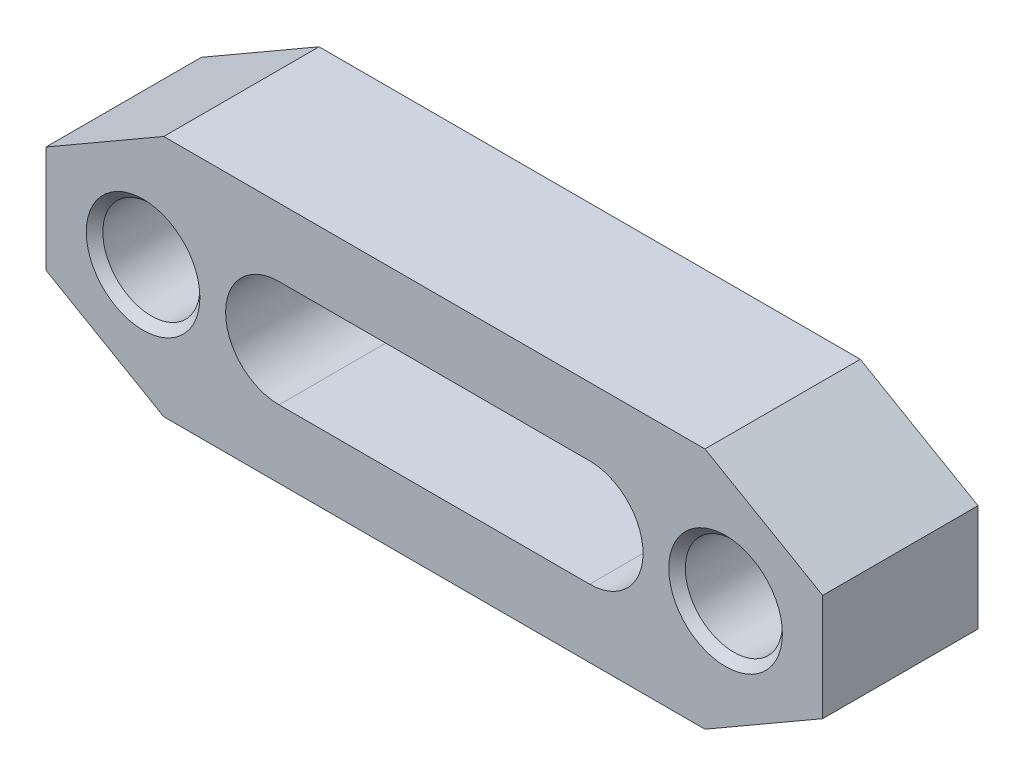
ISO-10303-21;
HEADER;
FILE_DESCRIPTION(('STEP AP214'),'2;1');
FILE_NAME('part.step','',(''),(''),'','','');
FILE_SCHEMA(('AUTOMOTIVE_DESIGN { 1 0 10303 214 1 1 1 1 }'));
ENDSEC;
DATA;
#1=APPLICATION_CONTEXT('core data for automotive mechanical design processes');
#2=APPLICATION_PROTOCOL_DEFINITION('international standard','automotive_design',2000,#1);
#3=PRODUCT_CONTEXT('',#1,'mechanical');
#4=PRODUCT('Part','Part','',(#3));
#5=PRODUCT_RELATED_PRODUCT_CATEGORY('part','',(#4));
#6=PRODUCT_DEFINITION_FORMATION('','',#4);
#7=PRODUCT_DEFINITION_CONTEXT('part definition',#1,'design');
#8=PRODUCT_DEFINITION('design','',#6,#7);
#9=PRODUCT_DEFINITION_SHAPE('','',#8);
#10=(LENGTH_UNIT() NAMED_UNIT(*) SI_UNIT(.MILLI.,.METRE.));
#11=(NAMED_UNIT(*) PLANE_ANGLE_UNIT() SI_UNIT($,.RADIAN.));
#12=(NAMED_UNIT(*) SI_UNIT($,.STERADIAN.) SOLID_ANGLE_UNIT());
#13=UNCERTAINTY_MEASURE_WITH_UNIT(LENGTH_MEASURE(1.E-05),#10,'distance_accuracy_value','');
#14=(GEOMETRIC_REPRESENTATION_CONTEXT(3) GLOBAL_UNCERTAINTY_ASSIGNED_CONTEXT((#13)) GLOBAL_UNIT_ASSIGNED_CONTEXT((#10,
#11,#12)) REPRESENTATION_CONTEXT('',''));
#15=CARTESIAN_POINT('',(0.,0.,0.));
#16=DIRECTION('',(0.,0.,1.));
#17=DIRECTION('',(1.,0.,0.));
#18=AXIS2_PLACEMENT_3D('',#15,#16,#17);
#19=CARTESIAN_POINT('',(40.,-12.5,16.));
#20=DIRECTION('',(0.,0.,1.));
#21=DIRECTION('',(1.,0.,0.));
#22=AXIS2_PLACEMENT_3D('',#19,#20,#21);
#23=PLANE('',#22);
#24=CARTESIAN_POINT('',(30.,0.,16.));
#25=DIRECTION('',(0.,0.,-1.));
#26=DIRECTION('',(-1.,0.,0.));
#27=AXIS2_PLACEMENT_3D('',#24,#25,#26);
#28=CIRCLE('',#27,5.85);
#29=CARTESIAN_POINT('',(24.15,0.,16.));
#30=VERTEX_POINT('',#29);
#31=EDGE_CURVE('E212',#30,#30,#28,.T.);
#32=ORIENTED_EDGE('',*,*,#31,.T.);
#33=EDGE_LOOP('',(#32));
#34=FACE_BOUND('',#33,.T.);
#35=CARTESIAN_POINT('',(-30.,0.,16.));
#36=DIRECTION('',(0.,0.,-1.));
#37=DIRECTION('',(-1.,0.,0.));
#38=AXIS2_PLACEMENT_3D('',#35,#36,#37);
#39=CIRCLE('',#38,5.85);
#40=CARTESIAN_POINT('',(-35.85,0.,16.));
#41=VERTEX_POINT('',#40);
#42=EDGE_CURVE('E133',#41,#41,#39,.T.);
#43=ORIENTED_EDGE('',*,*,#42,.T.);
#44=EDGE_LOOP('',(#43));
#45=FACE_BOUND('',#44,.T.);
#46=DIRECTION('',(1.,0.,0.));
#47=VECTOR('',#46,1.);
#48=CARTESIAN_POINT('',(-27.8756443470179,-12.5,16.));
#49=LINE('',#48,#47);
#50=CARTESIAN_POINT('',(-27.8756443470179,-12.5,16.));
#51=VERTEX_POINT('',#50);
#52=CARTESIAN_POINT('',(27.8756443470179,-12.5,16.));
#53=VERTEX_POINT('',#52);
#54=EDGE_CURVE('E143',#51,#53,#49,.T.);
#55=ORIENTED_EDGE('',*,*,#54,.T.);
#56=DIRECTION('',(0.866025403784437,0.5,0.));
#57=VECTOR('',#56,1.);
#58=CARTESIAN_POINT('',(27.8756443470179,-12.5,16.));
#59=LINE('',#58,#57);
#60=CARTESIAN_POINT('',(40.,-5.5,16.));
#61=VERTEX_POINT('',#60);
#62=EDGE_CURVE('E146',#53,#61,#59,.T.);
#63=ORIENTED_EDGE('',*,*,#62,.T.);
#64=DIRECTION('',(0.,1.,0.));
#65=VECTOR('',#64,1.);
#66=CARTESIAN_POINT('',(40.,-5.5,16.));
#67=LINE('',#66,#65);
#68=CARTESIAN_POINT('',(40.,5.5,16.));
#69=VERTEX_POINT('',#68);
#70=EDGE_CURVE('E149',#61,#69,#67,.T.);
#71=ORIENTED_EDGE('',*,*,#70,.T.);
#72=DIRECTION('',(-0.866025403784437,0.5,0.));
#73=VECTOR('',#72,1.);
#74=CARTESIAN_POINT('',(27.8756443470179,12.5,16.));
#75=LINE('',#74,#73);
#76=CARTESIAN_POINT('',(27.8756443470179,12.5,16.));
#77=VERTEX_POINT('',#76);
#78=EDGE_CURVE('E151',#69,#77,#75,.T.);
#79=ORIENTED_EDGE('',*,*,#78,.T.);
#80=DIRECTION('',(-1.,0.,0.));
#81=VECTOR('',#80,1.);
#82=CARTESIAN_POINT('',(-27.8756443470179,12.5,16.));
#83=LINE('',#82,#81);
#84=CARTESIAN_POINT('',(-27.8756443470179,12.5,16.));
#85=VERTEX_POINT('',#84);
#86=EDGE_CURVE('E153',#77,#85,#83,.T.);
#87=ORIENTED_EDGE('',*,*,#86,.T.);
#88=DIRECTION('',(-0.866025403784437,-0.5,0.));
#89=VECTOR('',#88,1.);
#90=CARTESIAN_POINT('',(-27.8756443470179,12.5,16.));
#91=LINE('',#90,#89);
#92=CARTESIAN_POINT('',(-40.,5.5,16.));
#93=VERTEX_POINT('',#92);
#94=EDGE_CURVE('E155',#85,#93,#91,.T.);
#95=ORIENTED_EDGE('',*,*,#94,.T.);
#96=DIRECTION('',(0.,-1.,0.));
#97=VECTOR('',#96,1.);
#98=CARTESIAN_POINT('',(-40.,-5.5,16.));
#99=LINE('',#98,#97);
#100=CARTESIAN_POINT('',(-40.,-5.5,16.));
#101=VERTEX_POINT('',#100);
#102=EDGE_CURVE('E157',#93,#101,#99,.T.);
#103=ORIENTED_EDGE('',*,*,#102,.T.);
#104=DIRECTION('',(0.866025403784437,-0.5,0.));
#105=VECTOR('',#104,1.);
#106=CARTESIAN_POINT('',(-27.8756443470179,-12.5,16.));
#107=LINE('',#106,#105);
#108=EDGE_CURVE('E159',#101,#51,#107,.T.);
#109=ORIENTED_EDGE('',*,*,#108,.T.);
#110=EDGE_LOOP('',(#55,#63,#71,#79,#87,#95,#103,#109));
#111=FACE_BOUND('',#110,.T.);
#112=DIRECTION('',(-1.,0.,0.));
#113=VECTOR('',#112,1.);
#114=CARTESIAN_POINT('',(16.,5.5,16.));
#115=LINE('',#114,#113);
#116=CARTESIAN_POINT('',(16.,5.5,16.));
#117=VERTEX_POINT('',#116);
#118=CARTESIAN_POINT('',(-16.,5.5,16.));
#119=VERTEX_POINT('',#118);
#120=EDGE_CURVE('E113',#117,#119,#115,.T.);
#121=ORIENTED_EDGE('',*,*,#120,.F.);
#122=CARTESIAN_POINT('',(16.,0.,16.));
#123=DIRECTION('',(0.,0.,1.));
#124=DIRECTION('',(1.,0.,0.));
#125=AXIS2_PLACEMENT_3D('',#122,#123,#124);
#126=CIRCLE('',#125,5.5);
#127=CARTESIAN_POINT('',(16.,-5.5,16.));
#128=VERTEX_POINT('',#127);
#129=EDGE_CURVE('E105',#128,#117,#126,.T.);
#130=ORIENTED_EDGE('',*,*,#129,.F.);
#131=DIRECTION('',(1.,0.,0.));
#132=VECTOR('',#131,1.);
#133=CARTESIAN_POINT('',(16.,-5.5,16.));
#134=LINE('',#133,#132);
#135=CARTESIAN_POINT('',(-16.,-5.5,16.));
#136=VERTEX_POINT('',#135);
#137=EDGE_CURVE('E127',#136,#128,#134,.T.);
#138=ORIENTED_EDGE('',*,*,#137,.F.);
#139=CARTESIAN_POINT('',(-16.,0.,16.));
#140=DIRECTION('',(0.,0.,1.));
#141=DIRECTION('',(1.,0.,0.));
#142=AXIS2_PLACEMENT_3D('',#139,#140,#141);
#143=CIRCLE('',#142,5.5);
#144=EDGE_CURVE('E125',#119,#136,#143,.T.);
#145=ORIENTED_EDGE('',*,*,#144,.F.);
#146=EDGE_LOOP('',(#121,#130,#138,#145));
#147=FACE_BOUND('',#146,.T.);
#148=ADVANCED_FACE('F14',(#34,#45,#111,#147),#23,.T.);
#149=CARTESIAN_POINT('',(40.,-12.5,0.));
#150=DIRECTION('',(0.,0.,1.));
#151=DIRECTION('',(1.,0.,0.));
#152=AXIS2_PLACEMENT_3D('',#149,#150,#151);
#153=PLANE('',#152);
#154=CARTESIAN_POINT('',(30.,0.,0.));
#155=DIRECTION('',(0.,0.,-1.));
#156=DIRECTION('',(-1.,0.,0.));
#157=AXIS2_PLACEMENT_3D('',#154,#155,#156);
#158=CIRCLE('',#157,5.85);
#159=CARTESIAN_POINT('',(24.15,0.,0.));
#160=VERTEX_POINT('',#159);
#161=EDGE_CURVE('E202',#160,#160,#158,.T.);
#162=ORIENTED_EDGE('',*,*,#161,.F.);
#163=EDGE_LOOP('',(#162));
#164=FACE_BOUND('',#163,.T.);
#165=CARTESIAN_POINT('',(-30.,0.,0.));
#166=DIRECTION('',(0.,0.,-1.));
#167=DIRECTION('',(-1.,0.,0.));
#168=AXIS2_PLACEMENT_3D('',#165,#166,#167);
#169=CIRCLE('',#168,5.85);
#170=CARTESIAN_POINT('',(-35.85,0.,0.));
#171=VERTEX_POINT('',#170);
#172=EDGE_CURVE('E215',#171,#171,#169,.T.);
#173=ORIENTED_EDGE('',*,*,#172,.F.);
#174=EDGE_LOOP('',(#173));
#175=FACE_BOUND('',#174,.T.);
#176=DIRECTION('',(1.,0.,0.));
#177=VECTOR('',#176,1.);
#178=CARTESIAN_POINT('',(-27.8756443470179,-12.5,0.));
#179=LINE('',#178,#177);
#180=CARTESIAN_POINT('',(-27.8756443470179,-12.5,0.));
#181=VERTEX_POINT('',#180);
#182=CARTESIAN_POINT('',(27.8756443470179,-12.5,0.));
#183=VERTEX_POINT('',#182);
#184=EDGE_CURVE('E121',#181,#183,#179,.T.);
#185=ORIENTED_EDGE('',*,*,#184,.F.);
#186=DIRECTION('',(0.866025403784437,-0.5,0.));
#187=VECTOR('',#186,1.);
#188=CARTESIAN_POINT('',(-27.8756443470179,-12.5,0.));
#189=LINE('',#188,#187);
#190=CARTESIAN_POINT('',(-40.,-5.5,0.));
#191=VERTEX_POINT('',#190);
#192=EDGE_CURVE('E147',#191,#181,#189,.T.);
#193=ORIENTED_EDGE('',*,*,#192,.F.);
#194=DIRECTION('',(0.,-1.,0.));
#195=VECTOR('',#194,1.);
#196=CARTESIAN_POINT('',(-40.,-5.5,0.));
#197=LINE('',#196,#195);
#198=CARTESIAN_POINT('',(-40.,5.5,0.));
#199=VERTEX_POINT('',#198);
#200=EDGE_CURVE('E174',#199,#191,#197,.T.);
#201=ORIENTED_EDGE('',*,*,#200,.F.);
#202=DIRECTION('',(-0.866025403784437,-0.5,0.));
#203=VECTOR('',#202,1.);
#204=CARTESIAN_POINT('',(-27.8756443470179,12.5,0.));
#205=LINE('',#204,#203);
#206=CARTESIAN_POINT('',(-27.8756443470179,12.5,0.));
#207=VERTEX_POINT('',#206);
#208=EDGE_CURVE('E172',#207,#199,#205,.T.);
#209=ORIENTED_EDGE('',*,*,#208,.F.);
#210=DIRECTION('',(-1.,0.,0.));
#211=VECTOR('',#210,1.);
#212=CARTESIAN_POINT('',(-27.8756443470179,12.5,0.));
#213=LINE('',#212,#211);
#214=CARTESIAN_POINT('',(27.8756443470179,12.5,0.));
#215=VERTEX_POINT('',#214);
#216=EDGE_CURVE('E170',#215,#207,#213,.T.);
#217=ORIENTED_EDGE('',*,*,#216,.F.);
#218=DIRECTION('',(-0.866025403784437,0.5,0.));
#219=VECTOR('',#218,1.);
#220=CARTESIAN_POINT('',(27.8756443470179,12.5,0.));
#221=LINE('',#220,#219);
#222=CARTESIAN_POINT('',(40.,5.5,0.));
#223=VERTEX_POINT('',#222);
#224=EDGE_CURVE('E168',#223,#215,#221,.T.);
#225=ORIENTED_EDGE('',*,*,#224,.F.);
#226=DIRECTION('',(0.,1.,0.));
#227=VECTOR('',#226,1.);
#228=CARTESIAN_POINT('',(40.,-5.5,0.));
#229=LINE('',#228,#227);
#230=CARTESIAN_POINT('',(40.,-5.5,0.));
#231=VERTEX_POINT('',#230);
#232=EDGE_CURVE('E166',#231,#223,#229,.T.);
#233=ORIENTED_EDGE('',*,*,#232,.F.);
#234=DIRECTION('',(0.866025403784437,0.5,0.));
#235=VECTOR('',#234,1.);
#236=CARTESIAN_POINT('',(27.8756443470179,-12.5,0.));
#237=LINE('',#236,#235);
#238=EDGE_CURVE('E164',#183,#231,#237,.T.);
#239=ORIENTED_EDGE('',*,*,#238,.F.);
#240=EDGE_LOOP('',(#185,#193,#201,#209,#217,#225,#233,#239));
#241=FACE_BOUND('',#240,.T.);
#242=CARTESIAN_POINT('',(16.,0.,0.));
#243=DIRECTION('',(0.,0.,1.));
#244=DIRECTION('',(1.,0.,0.));
#245=AXIS2_PLACEMENT_3D('',#242,#243,#244);
#246=CIRCLE('',#245,5.5);
#247=CARTESIAN_POINT('',(16.,-5.5,0.));
#248=VERTEX_POINT('',#247);
#249=CARTESIAN_POINT('',(16.,5.5,0.));
#250=VERTEX_POINT('',#249);
#251=EDGE_CURVE('E39',#248,#250,#246,.T.);
#252=ORIENTED_EDGE('',*,*,#251,.T.);
#253=DIRECTION('',(-1.,0.,0.));
#254=VECTOR('',#253,1.);
#255=CARTESIAN_POINT('',(16.,5.5,0.));
#256=LINE('',#255,#254);
#257=CARTESIAN_POINT('',(-16.,5.5,0.));
#258=VERTEX_POINT('',#257);
#259=EDGE_CURVE('E120',#250,#258,#256,.T.);
#260=ORIENTED_EDGE('',*,*,#259,.T.);
#261=CARTESIAN_POINT('',(-16.,0.,0.));
#262=DIRECTION('',(0.,0.,1.));
#263=DIRECTION('',(1.,0.,0.));
#264=AXIS2_PLACEMENT_3D('',#261,#262,#263);
#265=CIRCLE('',#264,5.5);
#266=CARTESIAN_POINT('',(-16.,-5.5,0.));
#267=VERTEX_POINT('',#266);
#268=EDGE_CURVE('E135',#258,#267,#265,.T.);
#269=ORIENTED_EDGE('',*,*,#268,.T.);
#270=DIRECTION('',(1.,0.,0.));
#271=VECTOR('',#270,1.);
#272=CARTESIAN_POINT('',(16.,-5.5,0.));
#273=LINE('',#272,#271);
#274=EDGE_CURVE('E114',#267,#248,#273,.T.);
#275=ORIENTED_EDGE('',*,*,#274,.T.);
#276=EDGE_LOOP('',(#252,#260,#269,#275));
#277=FACE_BOUND('',#276,.T.);
#278=ADVANCED_FACE('F238',(#164,#175,#241,#277),#153,.F.);
#279=CARTESIAN_POINT('',(-27.8756443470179,-12.5,16.));
#280=DIRECTION('',(0.,1.,0.));
#281=DIRECTION('',(-1.,0.,0.));
#282=AXIS2_PLACEMENT_3D('',#279,#280,#281);
#283=PLANE('',#282);
#284=ORIENTED_EDGE('',*,*,#184,.T.);
#285=DIRECTION('',(0.,0.,-1.));
#286=VECTOR('',#285,1.);
#287=CARTESIAN_POINT('',(27.8756443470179,-12.5,16.));
#288=LINE('',#287,#286);
#289=EDGE_CURVE('E9',#53,#183,#288,.T.);
#290=ORIENTED_EDGE('',*,*,#289,.F.);
#291=ORIENTED_EDGE('',*,*,#54,.F.);
#292=DIRECTION('',(0.,0.,-1.));
#293=VECTOR('',#292,1.);
#294=CARTESIAN_POINT('',(-27.8756443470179,-12.5,16.));
#295=LINE('',#294,#293);
#296=EDGE_CURVE('E161',#51,#181,#295,.T.);
#297=ORIENTED_EDGE('',*,*,#296,.T.);
#298=EDGE_LOOP('',(#284,#290,#291,#297));
#299=FACE_BOUND('',#298,.T.);
#300=ADVANCED_FACE('F16',(#299),#283,.F.);
#301=CARTESIAN_POINT('',(27.8756443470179,-12.5,16.));
#302=DIRECTION('',(-0.5,0.866025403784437,0.));
#303=DIRECTION('',(-0.866025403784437,-0.5,0.));
#304=AXIS2_PLACEMENT_3D('',#301,#302,#303);
#305=PLANE('',#304);
#306=ORIENTED_EDGE('',*,*,#238,.T.);
#307=DIRECTION('',(0.,0.,-1.));
#308=VECTOR('',#307,1.);
#309=CARTESIAN_POINT('',(40.,-5.5,16.));
#310=LINE('',#309,#308);
#311=EDGE_CURVE('E23',#61,#231,#310,.T.);
#312=ORIENTED_EDGE('',*,*,#311,.F.);
#313=ORIENTED_EDGE('',*,*,#62,.F.);
#314=ORIENTED_EDGE('',*,*,#289,.T.);
#315=EDGE_LOOP('',(#306,#312,#313,#314));
#316=FACE_BOUND('',#315,.T.);
#317=ADVANCED_FACE('F271',(#316),#305,.F.);
#318=CARTESIAN_POINT('',(40.,-5.5,16.));
#319=DIRECTION('',(-1.,0.,0.));
#320=DIRECTION('',(0.,0.,1.));
#321=AXIS2_PLACEMENT_3D('',#318,#319,#320);
#322=PLANE('',#321);
#323=ORIENTED_EDGE('',*,*,#232,.T.);
#324=DIRECTION('',(0.,0.,-1.));
#325=VECTOR('',#324,1.);
#326=CARTESIAN_POINT('',(40.,5.5,16.));
#327=LINE('',#326,#325);
#328=EDGE_CURVE('E191',#69,#223,#327,.T.);
#329=ORIENTED_EDGE('',*,*,#328,.F.);
#330=ORIENTED_EDGE('',*,*,#70,.F.);
#331=ORIENTED_EDGE('',*,*,#311,.T.);
#332=EDGE_LOOP('',(#323,#329,#330,#331));
#333=FACE_BOUND('',#332,.T.);
#334=ADVANCED_FACE('F268',(#333),#322,.F.);
#335=CARTESIAN_POINT('',(27.8756443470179,12.5,16.));
#336=DIRECTION('',(-0.5,-0.866025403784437,0.));
#337=DIRECTION('',(0.866025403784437,-0.5,0.));
#338=AXIS2_PLACEMENT_3D('',#335,#336,#337);
#339=PLANE('',#338);
#340=ORIENTED_EDGE('',*,*,#224,.T.);
#341=DIRECTION('',(0.,0.,-1.));
#342=VECTOR('',#341,1.);
#343=CARTESIAN_POINT('',(27.8756443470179,12.5,16.));
#344=LINE('',#343,#342);
#345=EDGE_CURVE('E188',#77,#215,#344,.T.);
#346=ORIENTED_EDGE('',*,*,#345,.F.);
#347=ORIENTED_EDGE('',*,*,#78,.F.);
#348=ORIENTED_EDGE('',*,*,#328,.T.);
#349=EDGE_LOOP('',(#340,#346,#347,#348));
#350=FACE_BOUND('',#349,.T.);
#351=ADVANCED_FACE('F264',(#350),#339,.F.);
#352=CARTESIAN_POINT('',(-27.8756443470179,12.5,16.));
#353=DIRECTION('',(0.,-1.,0.));
#354=DIRECTION('',(0.,0.,-1.));
#355=AXIS2_PLACEMENT_3D('',#352,#353,#354);
#356=PLANE('',#355);
#357=ORIENTED_EDGE('',*,*,#216,.T.);
#358=DIRECTION('',(0.,0.,-1.));
#359=VECTOR('',#358,1.);
#360=CARTESIAN_POINT('',(-27.8756443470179,12.5,16.));
#361=LINE('',#360,#359);
#362=EDGE_CURVE('E185',#85,#207,#361,.T.);
#363=ORIENTED_EDGE('',*,*,#362,.F.);
#364=ORIENTED_EDGE('',*,*,#86,.F.);
#365=ORIENTED_EDGE('',*,*,#345,.T.);
#366=EDGE_LOOP('',(#357,#363,#364,#365));
#367=FACE_BOUND('',#366,.T.);
#368=ADVANCED_FACE('F260',(#367),#356,.F.);
#369=CARTESIAN_POINT('',(-27.8756443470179,12.5,16.));
#370=DIRECTION('',(0.5,-0.866025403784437,0.));
#371=DIRECTION('',(0.866025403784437,0.5,0.));
#372=AXIS2_PLACEMENT_3D('',#369,#370,#371);
#373=PLANE('',#372);
#374=ORIENTED_EDGE('',*,*,#208,.T.);
#375=DIRECTION('',(0.,0.,-1.));
#376=VECTOR('',#375,1.);
#377=CARTESIAN_POINT('',(-40.,5.5,16.));
#378=LINE('',#377,#376);
#379=EDGE_CURVE('E182',#93,#199,#378,.T.);
#380=ORIENTED_EDGE('',*,*,#379,.F.);
#381=ORIENTED_EDGE('',*,*,#94,.F.);
#382=ORIENTED_EDGE('',*,*,#362,.T.);
#383=EDGE_LOOP('',(#374,#380,#381,#382));
#384=FACE_BOUND('',#383,.T.);
#385=ADVANCED_FACE('F256',(#384),#373,.F.);
#386=CARTESIAN_POINT('',(-40.,-5.5,16.));
#387=DIRECTION('',(1.,0.,0.));
#388=DIRECTION('',(0.,0.,-1.));
#389=AXIS2_PLACEMENT_3D('',#386,#387,#388);
#390=PLANE('',#389);
#391=ORIENTED_EDGE('',*,*,#200,.T.);
#392=DIRECTION('',(0.,0.,-1.));
#393=VECTOR('',#392,1.);
#394=CARTESIAN_POINT('',(-40.,-5.5,16.));
#395=LINE('',#394,#393);
#396=EDGE_CURVE('E179',#101,#191,#395,.T.);
#397=ORIENTED_EDGE('',*,*,#396,.F.);
#398=ORIENTED_EDGE('',*,*,#102,.F.);
#399=ORIENTED_EDGE('',*,*,#379,.T.);
#400=EDGE_LOOP('',(#391,#397,#398,#399));
#401=FACE_BOUND('',#400,.T.);
#402=ADVANCED_FACE('F252',(#401),#390,.F.);
#403=CARTESIAN_POINT('',(-27.8756443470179,-12.5,16.));
#404=DIRECTION('',(0.5,0.866025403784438,0.));
#405=DIRECTION('',(-0.866025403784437,0.5,0.));
#406=AXIS2_PLACEMENT_3D('',#403,#404,#405);
#407=PLANE('',#406);
#408=ORIENTED_EDGE('',*,*,#192,.T.);
#409=ORIENTED_EDGE('',*,*,#296,.F.);
#410=ORIENTED_EDGE('',*,*,#108,.F.);
#411=ORIENTED_EDGE('',*,*,#396,.T.);
#412=EDGE_LOOP('',(#408,#409,#410,#411));
#413=FACE_BOUND('',#412,.T.);
#414=ADVANCED_FACE('F249',(#413),#407,.F.);
#415=CARTESIAN_POINT('',(16.,0.,16.));
#416=DIRECTION('',(0.,0.,-1.));
#417=DIRECTION('',(-1.,0.,0.));
#418=AXIS2_PLACEMENT_3D('',#415,#416,#417);
#419=CYLINDRICAL_SURFACE('',#418,5.5);
#420=ORIENTED_EDGE('',*,*,#251,.F.);
#421=DIRECTION('',(0.,0.,-1.));
#422=VECTOR('',#421,1.);
#423=CARTESIAN_POINT('',(16.,-5.5,16.));
#424=LINE('',#423,#422);
#425=EDGE_CURVE('E109',#128,#248,#424,.T.);
#426=ORIENTED_EDGE('',*,*,#425,.F.);
#427=ORIENTED_EDGE('',*,*,#129,.T.);
#428=DIRECTION('',(0.,0.,-1.));
#429=VECTOR('',#428,1.);
#430=CARTESIAN_POINT('',(16.,5.5,16.));
#431=LINE('',#430,#429);
#432=EDGE_CURVE('E108',#117,#250,#431,.T.);
#433=ORIENTED_EDGE('',*,*,#432,.T.);
#434=EDGE_LOOP('',(#420,#426,#427,#433));
#435=FACE_BOUND('',#434,.T.);
#436=ADVANCED_FACE('F107',(#435),#419,.F.);
#437=CARTESIAN_POINT('',(16.,5.5,16.));
#438=DIRECTION('',(0.,-1.,0.));
#439=DIRECTION('',(1.,0.,0.));
#440=AXIS2_PLACEMENT_3D('',#437,#438,#439);
#441=PLANE('',#440);
#442=ORIENTED_EDGE('',*,*,#259,.F.);
#443=ORIENTED_EDGE('',*,*,#432,.F.);
#444=ORIENTED_EDGE('',*,*,#120,.T.);
#445=DIRECTION('',(0.,0.,-1.));
#446=VECTOR('',#445,1.);
#447=CARTESIAN_POINT('',(-16.,5.5,16.));
#448=LINE('',#447,#446);
#449=EDGE_CURVE('E122',#119,#258,#448,.T.);
#450=ORIENTED_EDGE('',*,*,#449,.T.);
#451=EDGE_LOOP('',(#442,#443,#444,#450));
#452=FACE_BOUND('',#451,.T.);
#453=ADVANCED_FACE('F117',(#452),#441,.T.);
#454=CARTESIAN_POINT('',(-16.,0.,16.));
#455=DIRECTION('',(0.,0.,-1.));
#456=DIRECTION('',(-1.,0.,0.));
#457=AXIS2_PLACEMENT_3D('',#454,#455,#456);
#458=CYLINDRICAL_SURFACE('',#457,5.5);
#459=ORIENTED_EDGE('',*,*,#268,.F.);
#460=ORIENTED_EDGE('',*,*,#449,.F.);
#461=ORIENTED_EDGE('',*,*,#144,.T.);
#462=DIRECTION('',(0.,0.,-1.));
#463=VECTOR('',#462,1.);
#464=CARTESIAN_POINT('',(-16.,-5.5,16.));
#465=LINE('',#464,#463);
#466=EDGE_CURVE('E31',#136,#267,#465,.T.);
#467=ORIENTED_EDGE('',*,*,#466,.T.);
#468=EDGE_LOOP('',(#459,#460,#461,#467));
#469=FACE_BOUND('',#468,.T.);
#470=ADVANCED_FACE('F235',(#469),#458,.F.);
#471=CARTESIAN_POINT('',(16.,-5.5,16.));
#472=DIRECTION('',(0.,1.,0.));
#473=DIRECTION('',(-1.,0.,0.));
#474=AXIS2_PLACEMENT_3D('',#471,#472,#473);
#475=PLANE('',#474);
#476=ORIENTED_EDGE('',*,*,#274,.F.);
#477=ORIENTED_EDGE('',*,*,#466,.F.);
#478=ORIENTED_EDGE('',*,*,#137,.T.);
#479=ORIENTED_EDGE('',*,*,#425,.T.);
#480=EDGE_LOOP('',(#476,#477,#478,#479));
#481=FACE_BOUND('',#480,.T.);
#482=ADVANCED_FACE('F225',(#481),#475,.T.);
#483=CARTESIAN_POINT('',(-30.,0.,14.5));
#484=DIRECTION('',(0.,0.,1.));
#485=DIRECTION('',(1.,0.,0.));
#486=AXIS2_PLACEMENT_3D('',#483,#484,#485);
#487=CONICAL_SURFACE('',#486,4.35,0.785398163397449);
#488=CARTESIAN_POINT('',(-30.,0.,15.15));
#489=DIRECTION('',(0.,0.,1.));
#490=DIRECTION('',(1.,0.,0.));
#491=AXIS2_PLACEMENT_3D('',#488,#489,#490);
#492=CIRCLE('',#491,5.);
#493=CARTESIAN_POINT('',(-25.,0.,15.15));
#494=VERTEX_POINT('',#493);
#495=EDGE_CURVE('E197',#494,#494,#492,.F.);
#496=ORIENTED_EDGE('',*,*,#495,.T.);
#497=EDGE_LOOP('',(#496));
#498=FACE_BOUND('',#497,.T.);
#499=ORIENTED_EDGE('',*,*,#42,.F.);
#500=EDGE_LOOP('',(#499));
#501=FACE_BOUND('',#500,.T.);
#502=ADVANCED_FACE('F222',(#498,#501),#487,.F.);
#503=CARTESIAN_POINT('',(-30.,0.,0.));
#504=DIRECTION('',(0.,0.,-1.));
#505=DIRECTION('',(-1.,0.,0.));
#506=AXIS2_PLACEMENT_3D('',#503,#504,#505);
#507=CONICAL_SURFACE('',#506,5.85,0.78539816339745);
#508=CARTESIAN_POINT('',(-30.,0.,0.85));
#509=DIRECTION('',(0.,0.,-1.));
#510=DIRECTION('',(-1.,0.,0.));
#511=AXIS2_PLACEMENT_3D('',#508,#509,#510);
#512=CIRCLE('',#511,5.);
#513=CARTESIAN_POINT('',(-35.,0.,0.85));
#514=VERTEX_POINT('',#513);
#515=EDGE_CURVE('E195',#514,#514,#512,.F.);
#516=ORIENTED_EDGE('',*,*,#515,.T.);
#517=EDGE_LOOP('',(#516));
#518=FACE_BOUND('',#517,.T.);
#519=ORIENTED_EDGE('',*,*,#172,.T.);
#520=EDGE_LOOP('',(#519));
#521=FACE_BOUND('',#520,.T.);
#522=ADVANCED_FACE('F224',(#518,#521),#507,.F.);
#523=CARTESIAN_POINT('',(30.,0.,14.5));
#524=DIRECTION('',(0.,0.,1.));
#525=DIRECTION('',(1.,0.,0.));
#526=AXIS2_PLACEMENT_3D('',#523,#524,#525);
#527=CONICAL_SURFACE('',#526,4.35,0.785398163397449);
#528=CARTESIAN_POINT('',(30.,0.,15.15));
#529=DIRECTION('',(0.,0.,1.));
#530=DIRECTION('',(1.,0.,0.));
#531=AXIS2_PLACEMENT_3D('',#528,#529,#530);
#532=CIRCLE('',#531,5.);
#533=CARTESIAN_POINT('',(35.,0.,15.15));
#534=VERTEX_POINT('',#533);
#535=EDGE_CURVE('E198',#534,#534,#532,.F.);
#536=ORIENTED_EDGE('',*,*,#535,.T.);
#537=EDGE_LOOP('',(#536));
#538=FACE_BOUND('',#537,.T.);
#539=ORIENTED_EDGE('',*,*,#31,.F.);
#540=EDGE_LOOP('',(#539));
#541=FACE_BOUND('',#540,.T.);
#542=ADVANCED_FACE('F233',(#538,#541),#527,.F.);
#543=CARTESIAN_POINT('',(30.,0.,0.));
#544=DIRECTION('',(0.,0.,-1.));
#545=DIRECTION('',(-1.,0.,0.));
#546=AXIS2_PLACEMENT_3D('',#543,#544,#545);
#547=CONICAL_SURFACE('',#546,5.85,0.785398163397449);
#548=CARTESIAN_POINT('',(30.,0.,0.85));
#549=DIRECTION('',(0.,0.,-1.));
#550=DIRECTION('',(-1.,0.,0.));
#551=AXIS2_PLACEMENT_3D('',#548,#549,#550);
#552=CIRCLE('',#551,5.);
#553=CARTESIAN_POINT('',(25.,0.,0.85));
#554=VERTEX_POINT('',#553);
#555=EDGE_CURVE('E18',#554,#554,#552,.F.);
#556=ORIENTED_EDGE('',*,*,#555,.T.);
#557=EDGE_LOOP('',(#556));
#558=FACE_BOUND('',#557,.T.);
#559=ORIENTED_EDGE('',*,*,#161,.T.);
#560=EDGE_LOOP('',(#559));
#561=FACE_BOUND('',#560,.T.);
#562=ADVANCED_FACE('F398',(#558,#561),#547,.F.);
#563=CARTESIAN_POINT('',(-30.,0.,0.));
#564=DIRECTION('',(0.,0.,1.));
#565=DIRECTION('',(1.,0.,0.));
#566=AXIS2_PLACEMENT_3D('',#563,#564,#565);
#567=CYLINDRICAL_SURFACE('',#566,5.);
#568=ORIENTED_EDGE('',*,*,#515,.F.);
#569=EDGE_LOOP('',(#568));
#570=FACE_BOUND('',#569,.T.);
#571=ORIENTED_EDGE('',*,*,#495,.F.);
#572=EDGE_LOOP('',(#571));
#573=FACE_BOUND('',#572,.T.);
#574=ADVANCED_FACE('F407',(#570,#573),#567,.F.);
#575=CARTESIAN_POINT('',(30.,0.,0.));
#576=DIRECTION('',(0.,0.,1.));
#577=DIRECTION('',(1.,0.,0.));
#578=AXIS2_PLACEMENT_3D('',#575,#576,#577);
#579=CYLINDRICAL_SURFACE('',#578,5.);
#580=ORIENTED_EDGE('',*,*,#555,.F.);
#581=EDGE_LOOP('',(#580));
#582=FACE_BOUND('',#581,.T.);
#583=ORIENTED_EDGE('',*,*,#535,.F.);
#584=EDGE_LOOP('',(#583));
#585=FACE_BOUND('',#584,.T.);
#586=ADVANCED_FACE('F417',(#582,#585),#579,.F.);
#587=CLOSED_SHELL('',(#148,#278,#300,#317,#334,#351,#368,#385,#402,#414,#436,#453,#470,#482,
#502,#522,#542,#562,#574,#586));
#588=MANIFOLD_SOLID_BREP('B1',#587);
#589=ADVANCED_BREP_SHAPE_REPRESENTATION('',(#18,#588),#14);
#590=SHAPE_DEFINITION_REPRESENTATION(#9,#589);
ENDSEC;
END-ISO-10303-21;
